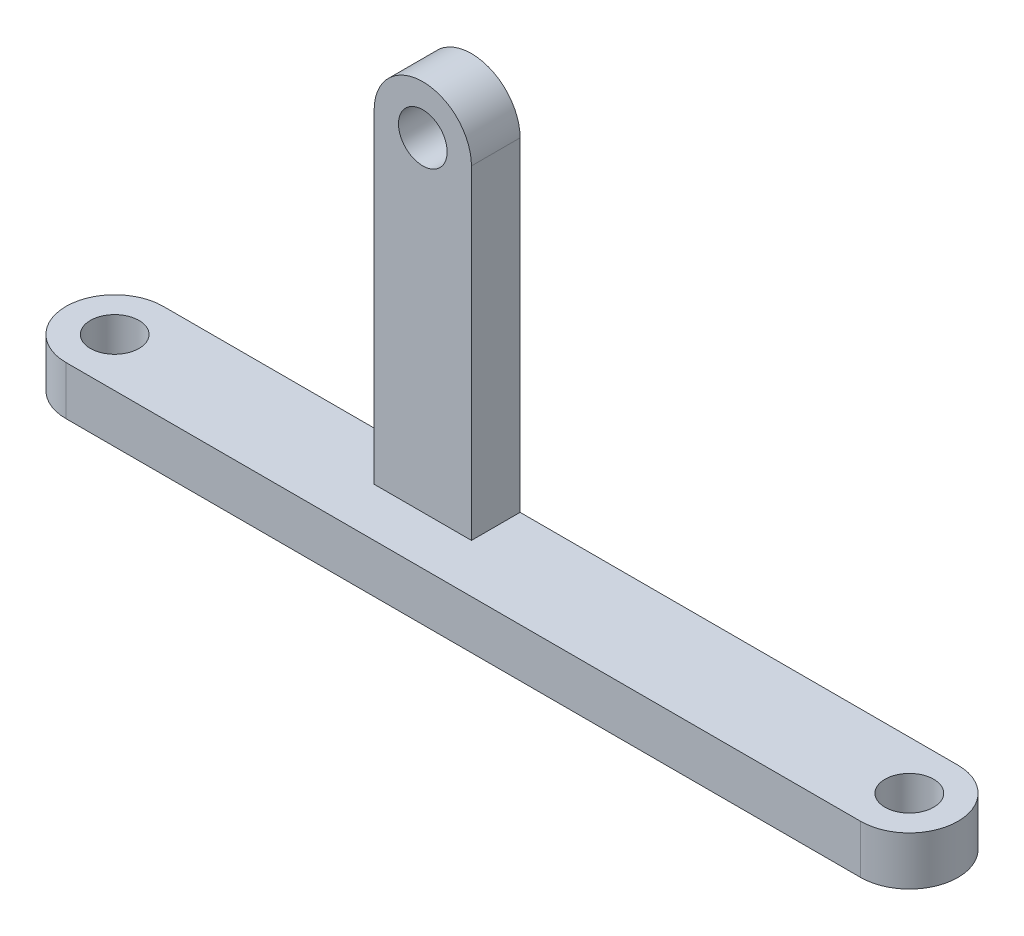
from build123d import *

# Parameters (mm, degrees)
SKETCH1_R           = 1.5
BOSS_EXTRUDE1_DEPTH = 3
SKETCH2_R           = 1.5
BOSS_EXTRUDE2_DEPTH = 3


with BuildPart() as part:
    # Sketch1 → Boss-Extrude1 (new body)
    # profile 1 of 3: a face of its own
    with BuildSketch(Plane.XY):
        with BuildLine():
            Line((3, 0), (3, 17))
            ThreePointArc((3, 17), (0, 20), (-3, 17))
            Line((-3, 17), (-3, 0))
            ThreePointArc((-3, 0), (-2.12132034, -2.121320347), (9e-09, -3))
            ThreePointArc((9e-09, -3), (2.121320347, -2.12132034), (3, 0))
        make_face()
        with Locations((0, 17)):
            Circle(SKETCH1_R, mode=Mode.SUBTRACT)
    # profile 2 of 3: a face of its own
    with BuildSketch(Plane.XY):
        with BuildLine():
            Line((3, -3), (3, 0))
            ThreePointArc((3, 0), (2.121320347, -2.12132034), (9e-09, -3))
            Line((9e-09, -3), (3, -3))
        make_face()
    # profile 3 of 3: a face of its own
    with BuildSketch(Plane.XY):
        with BuildLine():
            Line((-3, -3), (9e-09, -3))
            ThreePointArc((9e-09, -3), (-2.12132034, -2.121320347), (-3, 0))
            Line((-3, 0), (-3, -3))
        make_face()
    extrude(amount=BOSS_EXTRUDE1_DEPTH)

    # Sketch2 → Boss-Extrude2 (add)
    with BuildSketch(Plane.XZ.offset(3)):
        with BuildLine():
            Line((-19, 6), (30, 6))
            ThreePointArc((30, 6), (33, 3), (30, 0))
            Line((30, 0), (-19, 0))
            ThreePointArc((-19, 0), (-22, 3), (-19, 6))
        make_face()
        with Locations((-19, 3)):
            Circle(SKETCH2_R, mode=Mode.SUBTRACT)
        with Locations((30, 3)):
            Circle(SKETCH2_R, mode=Mode.SUBTRACT)
    extrude(amount=BOSS_EXTRUDE2_DEPTH)


solid = part.part
